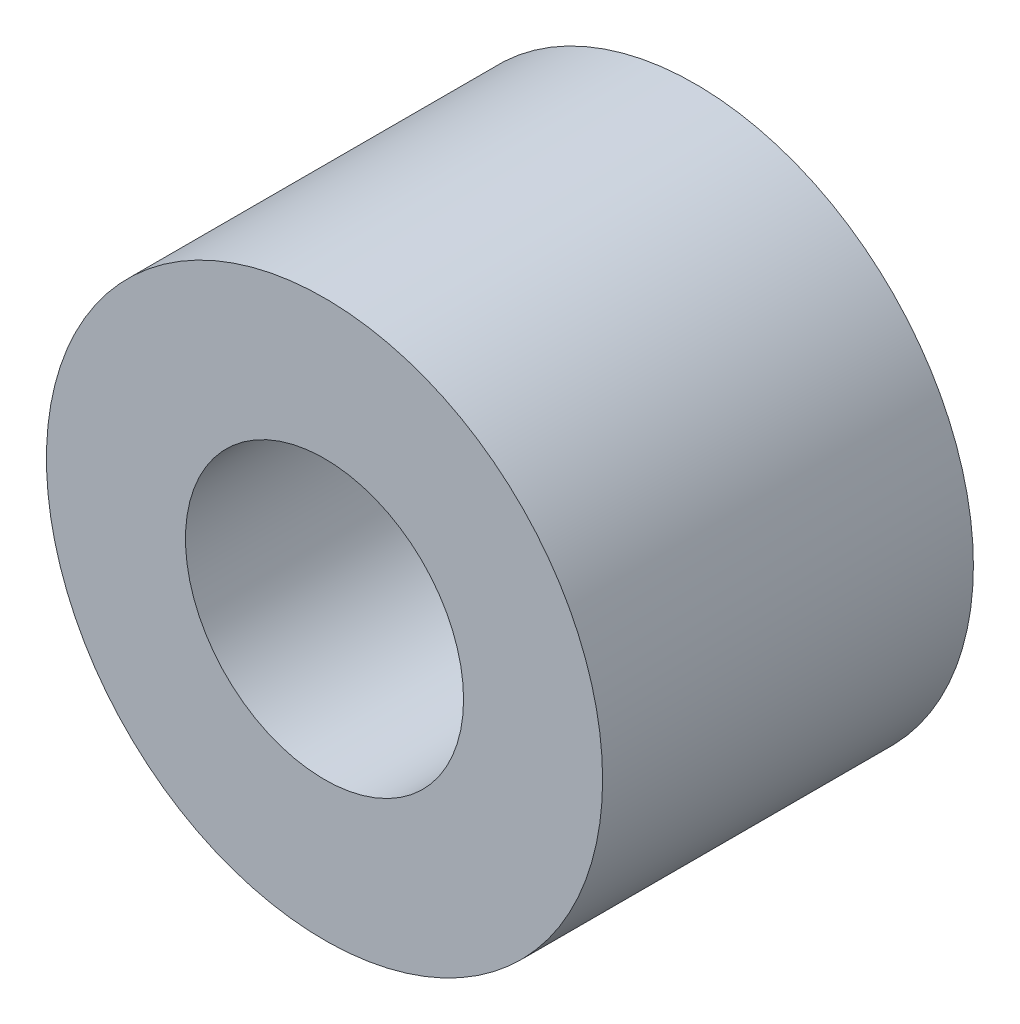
from build123d import *

# Parameters (mm, degrees)
ESQUISSE1_R      = 3
ESQUISSE1_R_2    = 1.5
EXTRUSION1_DEPTH = 4


with BuildPart() as part:
    # Esquisse1 → Extrusion1 (new body)
    with BuildSketch(Plane.XY):
        Circle(ESQUISSE1_R)
        Circle(ESQUISSE1_R_2, mode=Mode.SUBTRACT)
    extrude(amount=EXTRUSION1_DEPTH)


solid = part.part
